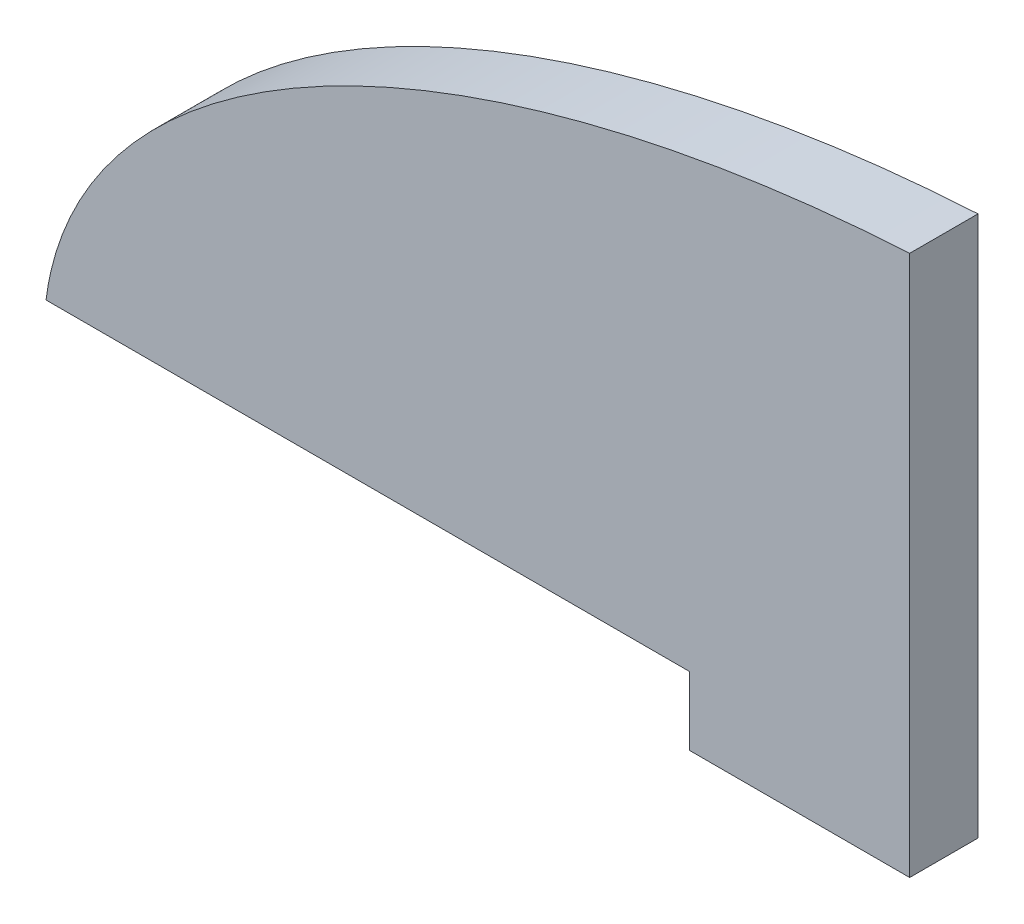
from build123d import *

# Parameters (mm, degrees)
BOSS_EXTRUDE1_DEPTH = 3.175


with BuildPart() as part:
    # Sketch1 → Boss-Extrude1 (new body)
    with BuildSketch(Plane.XY):
        with BuildLine():
            Line((-4.7625, 0), (-4.7625, 23.534148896))
            add(Edge.make_bspline(
                [(-4.7625, 23.534148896), (-42.362348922, 21.429467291), (-44.8986531, 1.5875)],
                knots=[4.818420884, 4.818420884, 4.818420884, 6.216058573, 6.216058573, 6.216058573], degree=2, weights=[1, 0.765602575, 1]))
            Line((-44.8986531, 1.5875), (-15, 1.5875))
            Line((-15, 1.5875), (-15, -1.5875))
            Line((-15, -1.5875), (-4.7625, -1.5875))
            Line((-4.7625, -1.5875), (-4.7625, 0))
        make_face()
    extrude(amount=BOSS_EXTRUDE1_DEPTH)


solid = part.part
